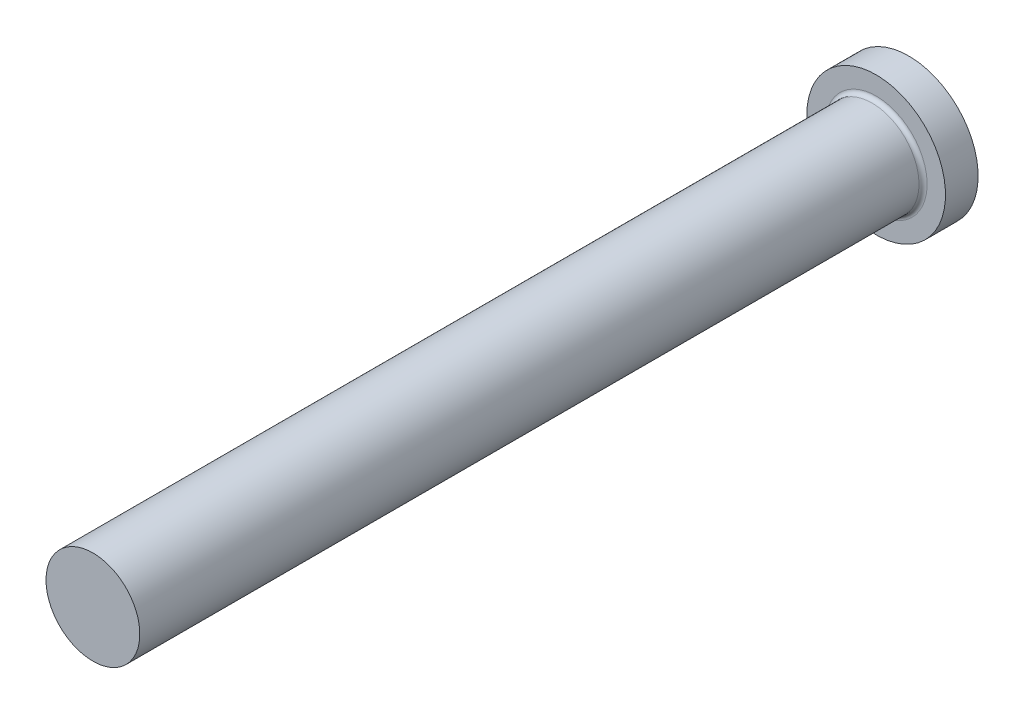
ISO-10303-21;
HEADER;
FILE_DESCRIPTION(('STEP AP214'),'2;1');
FILE_NAME('part.step','',(''),(''),'','','');
FILE_SCHEMA(('AUTOMOTIVE_DESIGN { 1 0 10303 214 1 1 1 1 }'));
ENDSEC;
DATA;
#1=APPLICATION_CONTEXT('core data for automotive mechanical design processes');
#2=APPLICATION_PROTOCOL_DEFINITION('international standard','automotive_design',2000,#1);
#3=PRODUCT_CONTEXT('',#1,'mechanical');
#4=PRODUCT('Part','Part','',(#3));
#5=PRODUCT_RELATED_PRODUCT_CATEGORY('part','',(#4));
#6=PRODUCT_DEFINITION_FORMATION('','',#4);
#7=PRODUCT_DEFINITION_CONTEXT('part definition',#1,'design');
#8=PRODUCT_DEFINITION('design','',#6,#7);
#9=PRODUCT_DEFINITION_SHAPE('','',#8);
#10=(LENGTH_UNIT() NAMED_UNIT(*) SI_UNIT(.MILLI.,.METRE.));
#11=(NAMED_UNIT(*) PLANE_ANGLE_UNIT() SI_UNIT($,.RADIAN.));
#12=(NAMED_UNIT(*) SI_UNIT($,.STERADIAN.) SOLID_ANGLE_UNIT());
#13=UNCERTAINTY_MEASURE_WITH_UNIT(LENGTH_MEASURE(1.E-05),#10,'distance_accuracy_value','');
#14=(GEOMETRIC_REPRESENTATION_CONTEXT(3) GLOBAL_UNCERTAINTY_ASSIGNED_CONTEXT((#13)) GLOBAL_UNIT_ASSIGNED_CONTEXT((#10,
#11,#12)) REPRESENTATION_CONTEXT('',''));
#15=CARTESIAN_POINT('',(0.,0.,0.));
#16=DIRECTION('',(0.,0.,1.));
#17=DIRECTION('',(1.,0.,0.));
#18=AXIS2_PLACEMENT_3D('',#15,#16,#17);
#19=CARTESIAN_POINT('',(8.5,0.,4.));
#20=DIRECTION('',(0.,0.,-1.));
#21=DIRECTION('',(-1.,0.,0.));
#22=AXIS2_PLACEMENT_3D('',#19,#20,#21);
#23=PLANE('',#22);
#24=CARTESIAN_POINT('',(0.,0.,4.));
#25=DIRECTION('',(0.,0.,-1.));
#26=DIRECTION('',(-1.,0.,0.));
#27=AXIS2_PLACEMENT_3D('',#24,#25,#26);
#28=CIRCLE('',#27,6.25000000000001);
#29=CARTESIAN_POINT('',(-6.25000000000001,0.,4.));
#30=VERTEX_POINT('',#29);
#31=EDGE_CURVE('E40',#30,#30,#28,.T.);
#32=ORIENTED_EDGE('',*,*,#31,.T.);
#33=EDGE_LOOP('',(#32));
#34=FACE_BOUND('',#33,.T.);
#35=CARTESIAN_POINT('',(0.,0.,4.));
#36=DIRECTION('',(0.,0.,-1.));
#37=DIRECTION('',(-1.,0.,0.));
#38=AXIS2_PLACEMENT_3D('',#35,#36,#37);
#39=CIRCLE('',#38,8.5);
#40=CARTESIAN_POINT('',(-8.5,0.,4.));
#41=VERTEX_POINT('',#40);
#42=EDGE_CURVE('E44',#41,#41,#39,.T.);
#43=ORIENTED_EDGE('',*,*,#42,.F.);
#44=EDGE_LOOP('',(#43));
#45=FACE_BOUND('',#44,.T.);
#46=ADVANCED_FACE('F33',(#34,#45),#23,.F.);
#47=CARTESIAN_POINT('',(0.,0.,-9.03322817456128));
#48=DIRECTION('',(0.,0.,-1.));
#49=DIRECTION('',(-1.,0.,0.));
#50=AXIS2_PLACEMENT_3D('',#47,#48,#49);
#51=CYLINDRICAL_SURFACE('',#50,8.5);
#52=CARTESIAN_POINT('',(0.,0.,0.));
#53=DIRECTION('',(0.,0.,-1.));
#54=DIRECTION('',(-1.,0.,0.));
#55=AXIS2_PLACEMENT_3D('',#52,#53,#54);
#56=CIRCLE('',#55,8.5);
#57=CARTESIAN_POINT('',(-8.5,0.,0.));
#58=VERTEX_POINT('',#57);
#59=EDGE_CURVE('E48',#58,#58,#56,.T.);
#60=ORIENTED_EDGE('',*,*,#59,.F.);
#61=EDGE_LOOP('',(#60));
#62=FACE_BOUND('',#61,.T.);
#63=ORIENTED_EDGE('',*,*,#42,.T.);
#64=EDGE_LOOP('',(#63));
#65=FACE_BOUND('',#64,.T.);
#66=ADVANCED_FACE('F68',(#62,#65),#51,.T.);
#67=CARTESIAN_POINT('',(0.,0.,0.));
#68=DIRECTION('',(0.,0.,1.));
#69=DIRECTION('',(1.,0.,0.));
#70=AXIS2_PLACEMENT_3D('',#67,#68,#69);
#71=PLANE('',#70);
#72=ORIENTED_EDGE('',*,*,#59,.T.);
#73=EDGE_LOOP('',(#72));
#74=FACE_BOUND('',#73,.T.);
#75=ADVANCED_FACE('F61',(#74),#71,.F.);
#76=CARTESIAN_POINT('',(0.,0.,100.));
#77=DIRECTION('',(0.,0.,-1.));
#78=DIRECTION('',(-1.,0.,0.));
#79=AXIS2_PLACEMENT_3D('',#76,#77,#78);
#80=PLANE('',#79);
#81=CARTESIAN_POINT('',(0.,0.,100.));
#82=DIRECTION('',(0.,0.,-1.));
#83=DIRECTION('',(-1.,0.,0.));
#84=AXIS2_PLACEMENT_3D('',#81,#82,#83);
#85=CIRCLE('',#84,5.75000000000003);
#86=CARTESIAN_POINT('',(-5.75000000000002,0.,100.));
#87=VERTEX_POINT('',#86);
#88=EDGE_CURVE('E53',#87,#87,#85,.T.);
#89=ORIENTED_EDGE('',*,*,#88,.F.);
#90=EDGE_LOOP('',(#89));
#91=FACE_BOUND('',#90,.T.);
#92=ADVANCED_FACE('F59',(#91),#80,.F.);
#93=CARTESIAN_POINT('',(0.,0.,-9.03322817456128));
#94=DIRECTION('',(0.,0.,-1.));
#95=DIRECTION('',(-1.,0.,0.));
#96=AXIS2_PLACEMENT_3D('',#93,#94,#95);
#97=CYLINDRICAL_SURFACE('',#96,5.75000000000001);
#98=CARTESIAN_POINT('',(0.,0.,4.5));
#99=DIRECTION('',(0.,0.,-1.));
#100=DIRECTION('',(-1.,0.,0.));
#101=AXIS2_PLACEMENT_3D('',#98,#99,#100);
#102=CIRCLE('',#101,5.75000000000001);
#103=CARTESIAN_POINT('',(-5.75000000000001,0.,4.5));
#104=VERTEX_POINT('',#103);
#105=EDGE_CURVE('E10',#104,#104,#102,.F.);
#106=ORIENTED_EDGE('',*,*,#105,.T.);
#107=EDGE_LOOP('',(#106));
#108=FACE_BOUND('',#107,.T.);
#109=ORIENTED_EDGE('',*,*,#88,.T.);
#110=EDGE_LOOP('',(#109));
#111=FACE_BOUND('',#110,.T.);
#112=ADVANCED_FACE('F57',(#108,#111),#97,.T.);
#113=CARTESIAN_POINT('',(0.,0.,4.5));
#114=DIRECTION('',(0.,0.,-1.));
#115=DIRECTION('',(-1.,0.,0.));
#116=AXIS2_PLACEMENT_3D('',#113,#114,#115);
#117=TOROIDAL_SURFACE('',#116,6.25000000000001,0.5);
#118=ORIENTED_EDGE('',*,*,#105,.F.);
#119=EDGE_LOOP('',(#118));
#120=FACE_BOUND('',#119,.T.);
#121=ORIENTED_EDGE('',*,*,#31,.F.);
#122=EDGE_LOOP('',(#121));
#123=FACE_BOUND('',#122,.T.);
#124=ADVANCED_FACE('F35',(#120,#123),#117,.F.);
#125=CLOSED_SHELL('',(#46,#66,#75,#92,#112,#124));
#126=MANIFOLD_SOLID_BREP('B2',#125);
#127=ADVANCED_BREP_SHAPE_REPRESENTATION('',(#18,#126),#14);
#128=SHAPE_DEFINITION_REPRESENTATION(#9,#127);
ENDSEC;
END-ISO-10303-21;
